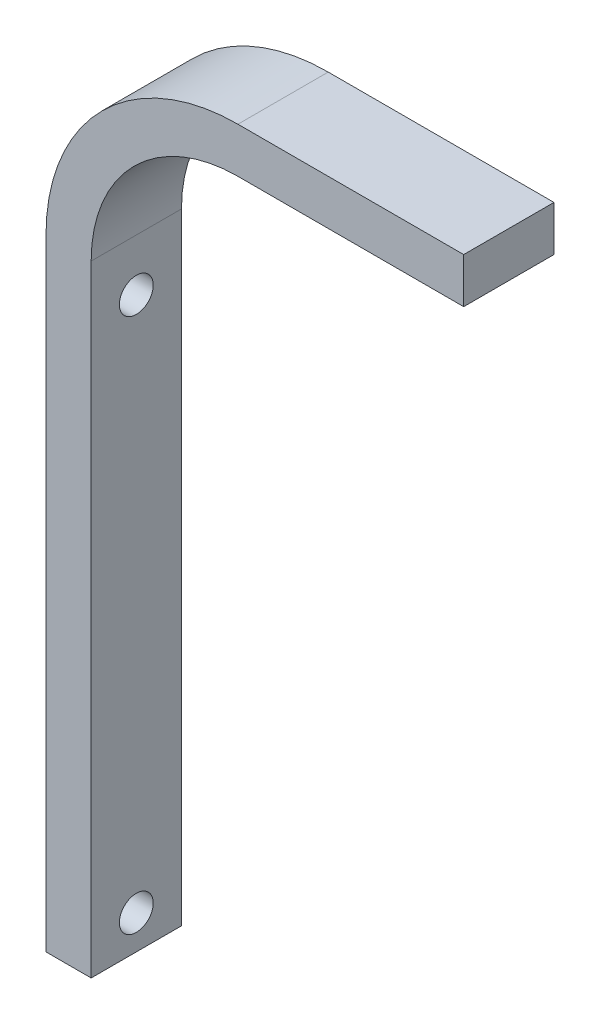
from build123d import *

# Parameters (mm, degrees)
BOSS_EXTRU_1_DEPTH           = 8
ENL_V_MAT_EXTRU_1_DEPTH      = 82.344944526
ENL_V_MAT_EXTRU_1_DEPTH_BACK = 82.344944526
ESQUISSE2_R                  = 1.5


with BuildPart() as part:
    # Esquisse1 → Boss.-Extru.1 (new body)
    with BuildSketch(Plane.XY):
        with BuildLine():
            Line((0, 0), (0, 55))
            ThreePointArc((0, 55), (4.97918472, 67.02081528), (17, 72))
            Line((17, 72), (37, 72))
            Line((37, 72), (37, 68))
            Line((37, 68), (17, 68))
            ThreePointArc((17, 68), (7.807611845, 64.192388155), (4, 55))
            Line((4, 55), (4, 0))
            Line((4, 0), (0, 0))
        make_face()
    extrude(amount=BOSS_EXTRU_1_DEPTH)

    # Esquisse2 → Enl_v. mat.-Extru.1 (cut, two sides: drawn at the far end of the back side and taken through both)
    with BuildSketch(Plane.ZY.offset(-ENL_V_MAT_EXTRU_1_DEPTH_BACK)):
        with Locations(Location((4, 3, 0), (0, 0, 270))):
            Circle(ESQUISSE2_R)
        with Locations(Location((4, 50.408675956, 0), (0, 0, 270))):
            Circle(ESQUISSE2_R)
    extrude(amount=ENL_V_MAT_EXTRU_1_DEPTH + ENL_V_MAT_EXTRU_1_DEPTH_BACK, mode=Mode.SUBTRACT)


solid = part.part
